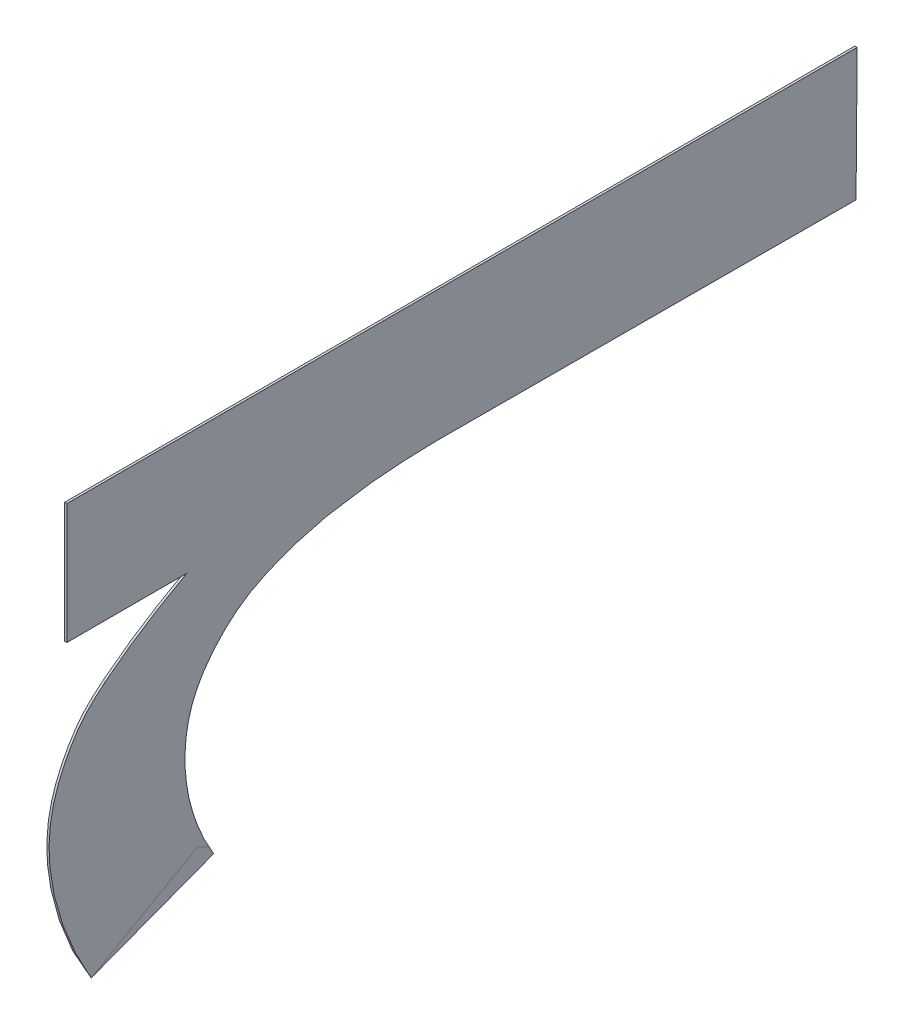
ISO-10303-21;
HEADER;
FILE_DESCRIPTION(('STEP AP214'),'2;1');
FILE_NAME('part.step','',(''),(''),'','','');
FILE_SCHEMA(('AUTOMOTIVE_DESIGN { 1 0 10303 214 1 1 1 1 }'));
ENDSEC;
DATA;
#1=APPLICATION_CONTEXT('core data for automotive mechanical design processes');
#2=APPLICATION_PROTOCOL_DEFINITION('international standard','automotive_design',2000,#1);
#3=PRODUCT_CONTEXT('',#1,'mechanical');
#4=PRODUCT('Part','Part','',(#3));
#5=PRODUCT_RELATED_PRODUCT_CATEGORY('part','',(#4));
#6=PRODUCT_DEFINITION_FORMATION('','',#4);
#7=PRODUCT_DEFINITION_CONTEXT('part definition',#1,'design');
#8=PRODUCT_DEFINITION('design','',#6,#7);
#9=PRODUCT_DEFINITION_SHAPE('','',#8);
#10=(LENGTH_UNIT() NAMED_UNIT(*) SI_UNIT(.MILLI.,.METRE.));
#11=(NAMED_UNIT(*) PLANE_ANGLE_UNIT() SI_UNIT($,.RADIAN.));
#12=(NAMED_UNIT(*) SI_UNIT($,.STERADIAN.) SOLID_ANGLE_UNIT());
#13=UNCERTAINTY_MEASURE_WITH_UNIT(LENGTH_MEASURE(1.E-05),#10,'distance_accuracy_value','');
#14=(GEOMETRIC_REPRESENTATION_CONTEXT(3) GLOBAL_UNCERTAINTY_ASSIGNED_CONTEXT((#13)) GLOBAL_UNIT_ASSIGNED_CONTEXT((#10,
#11,#12)) REPRESENTATION_CONTEXT('',''));
#15=CARTESIAN_POINT('',(0.,0.,0.));
#16=DIRECTION('',(0.,0.,1.));
#17=DIRECTION('',(1.,0.,0.));
#18=AXIS2_PLACEMENT_3D('',#15,#16,#17);
#19=CARTESIAN_POINT('',(-5.56,-5.122990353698,17.19421221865));
#20=DIRECTION('',(0.,0.,-1.));
#21=DIRECTION('',(-1.,0.,0.));
#22=AXIS2_PLACEMENT_3D('',#19,#20,#21);
#23=PLANE('',#22);
#24=DIRECTION('',(0.,-1.,0.));
#25=VECTOR('',#24,1.);
#26=CARTESIAN_POINT('',(-5.56,-5.620105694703,17.19421221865));
#27=LINE('',#26,#25);
#28=CARTESIAN_POINT('',(-5.56,-4.534565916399,17.19421221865));
#29=VERTEX_POINT('',#28);
#30=CARTESIAN_POINT('',(-5.555,-5.1229902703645,17.194212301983));
#31=VERTEX_POINT('',#30);
#32=EDGE_CURVE('E104',#29,#31,#27,.T.);
#33=ORIENTED_EDGE('',*,*,#32,.F.);
#34=DIRECTION('',(-1.,0.,0.));
#35=VECTOR('',#34,1.);
#36=CARTESIAN_POINT('',(-5.56,-4.534565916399,17.19421221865));
#37=LINE('',#36,#35);
#38=CARTESIAN_POINT('',(-5.55,-4.534565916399,17.19421221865));
#39=VERTEX_POINT('',#38);
#40=EDGE_CURVE('E140',#39,#29,#37,.T.);
#41=ORIENTED_EDGE('',*,*,#40,.F.);
#42=DIRECTION('',(0.,-1.,0.));
#43=VECTOR('',#42,1.);
#44=CARTESIAN_POINT('',(-5.55,-5.620105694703,17.19421221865));
#45=LINE('',#44,#43);
#46=EDGE_CURVE('E131',#39,#31,#45,.T.);
#47=ORIENTED_EDGE('',*,*,#46,.T.);
#48=EDGE_LOOP('',(#33,#41,#47));
#49=FACE_BOUND('',#48,.T.);
#50=ADVANCED_FACE('F17',(#49),#23,.T.);
#51=CARTESIAN_POINT('',(-5.55,-5.620105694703,20.746908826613));
#52=DIRECTION('',(-1.,0.,0.));
#53=DIRECTION('',(0.,-1.,0.));
#54=AXIS2_PLACEMENT_3D('',#51,#52,#53);
#55=PLANE('',#54);
#56=DIRECTION('',(0.,0.,1.));
#57=VECTOR('',#56,1.);
#58=CARTESIAN_POINT('',(-5.55,-4.534565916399,17.19421221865));
#59=LINE('',#58,#57);
#60=CARTESIAN_POINT('',(-5.55,-4.534565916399,20.699035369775));
#61=VERTEX_POINT('',#60);
#62=EDGE_CURVE('E143',#61,#39,#59,.F.);
#63=ORIENTED_EDGE('',*,*,#62,.F.);
#64=DIRECTION('',(0.,1.,0.));
#65=VECTOR('',#64,1.);
#66=CARTESIAN_POINT('',(-5.55,-4.534565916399,20.699035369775));
#67=LINE('',#66,#65);
#68=CARTESIAN_POINT('',(-5.55,-5.068327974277,20.699035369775));
#69=VERTEX_POINT('',#68);
#70=EDGE_CURVE('E90',#69,#61,#67,.T.);
#71=ORIENTED_EDGE('',*,*,#70,.F.);
#72=DIRECTION('',(0.,0.,1.));
#73=VECTOR('',#72,1.);
#74=CARTESIAN_POINT('',(-5.55,-5.068327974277,20.699035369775));
#75=LINE('',#74,#73);
#76=CARTESIAN_POINT('',(-5.55,-5.068327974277,20.168488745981));
#77=VERTEX_POINT('',#76);
#78=EDGE_CURVE('E91',#77,#69,#75,.T.);
#79=ORIENTED_EDGE('',*,*,#78,.F.);
#80=CARTESIAN_POINT('',(-5.55,-6.415594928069,20.586495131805));
#81=CARTESIAN_POINT('',(-5.55,-6.280176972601,20.670325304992));
#82=CARTESIAN_POINT('',(-5.55,-6.010180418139,20.780076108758));
#83=CARTESIAN_POINT('',(-5.55,-5.685238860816,20.792488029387));
#84=CARTESIAN_POINT('',(-5.55,-5.424851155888,20.658232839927));
#85=CARTESIAN_POINT('',(-5.55,-5.295983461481,20.53338967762));
#86=CARTESIAN_POINT('',(-5.55,-5.158919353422,20.33457294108));
#87=CARTESIAN_POINT('',(-5.55,-5.068327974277,20.168488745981));
#88=B_SPLINE_CURVE_WITH_KNOTS('',3,(#80,#81,#82,#83,#84,#85,#86,#87),.UNSPECIFIED.,.F.,.F.,(4,1,
1,1,1,4),(0.409840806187,0.447004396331,0.484167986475,0.502749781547,0.521331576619,
0.558495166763),.UNSPECIFIED.);
#89=CARTESIAN_POINT('',(-5.555,-6.41559487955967,20.5864951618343));
#90=VERTEX_POINT('',#89);
#91=EDGE_CURVE('E86',#90,#77,#88,.T.);
#92=ORIENTED_EDGE('',*,*,#91,.F.);
#93=CARTESIAN_POINT('',(-5.56,-6.209807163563,20.043087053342));
#94=DIRECTION('',(0.,-0.354153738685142,0.935187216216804));
#95=VECTOR('',#94,1.);
#96=LINE('',#93,#95);
#97=CARTESIAN_POINT('',(-5.555,-6.209807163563,20.043087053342));
#98=VERTEX_POINT('',#97);
#99=EDGE_CURVE('E74',#98,#90,#96,.T.);
#100=ORIENTED_EDGE('',*,*,#99,.F.);
#101=CARTESIAN_POINT('',(-5.56,-5.122990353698,17.19421221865));
#102=CARTESIAN_POINT('',(-5.56,-5.122990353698,19.0563915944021));
#103=CARTESIAN_POINT('',(-5.56,-5.12334341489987,19.0730340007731));
#104=CARTESIAN_POINT('',(-5.56,-5.13127077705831,19.446709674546));
#105=CARTESIAN_POINT('',(-5.56,-5.20528925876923,19.6753130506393));
#106=CARTESIAN_POINT('',(-5.56,-5.22766131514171,19.74440832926));
#107=CARTESIAN_POINT('',(-5.56,-5.25664159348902,19.8080417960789));
#108=CARTESIAN_POINT('',(-5.56,-5.29866135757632,19.9003067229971));
#109=CARTESIAN_POINT('',(-5.56,-5.35788951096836,19.9660303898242));
#110=CARTESIAN_POINT('',(-5.56,-5.44012689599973,20.0572866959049));
#111=CARTESIAN_POINT('',(-5.56,-5.53546514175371,20.1079869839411));
#112=CARTESIAN_POINT('',(-5.56,-5.62844010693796,20.1574304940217));
#113=CARTESIAN_POINT('',(-5.56,-5.74775554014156,20.1642888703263));
#114=CARTESIAN_POINT('',(-5.56,-5.97363928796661,20.1772729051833));
#115=CARTESIAN_POINT('',(-5.56,-6.209807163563,20.043087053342));
#116=B_SPLINE_CURVE_WITH_KNOTS('',2,(#101,#102,#103,#104,#105,#106,#107,#108,#109,#110,#111,
#112,#113,#114,#115),.UNSPECIFIED.,.F.,.F.,(3,2,2,2,2,2,2,3),(0.,0.5,0.642857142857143,
0.685714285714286,0.75,0.8125,0.875,1.),.UNSPECIFIED.);
#117=EDGE_CURVE('E103',#31,#98,#116,.T.);
#118=ORIENTED_EDGE('',*,*,#117,.F.);
#119=ORIENTED_EDGE('',*,*,#46,.F.);
#120=EDGE_LOOP('',(#63,#71,#79,#92,#100,#118,#119));
#121=FACE_BOUND('',#120,.T.);
#122=ADVANCED_FACE('F110',(#121),#55,.F.);
#123=CARTESIAN_POINT('',(-5.56,-5.068327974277,20.168488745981));
#124=CARTESIAN_POINT('',(-5.55,-5.068327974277,20.168488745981));
#125=CARTESIAN_POINT('',(-5.56,-5.158919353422,20.33457294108));
#126=CARTESIAN_POINT('',(-5.55,-5.158919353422,20.33457294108));
#127=CARTESIAN_POINT('',(-5.56,-5.295983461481,20.53338967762));
#128=CARTESIAN_POINT('',(-5.55,-5.295983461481,20.53338967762));
#129=CARTESIAN_POINT('',(-5.56,-5.424851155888,20.658232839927));
#130=CARTESIAN_POINT('',(-5.55,-5.424851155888,20.658232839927));
#131=CARTESIAN_POINT('',(-5.56,-5.685238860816,20.792488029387));
#132=CARTESIAN_POINT('',(-5.55,-5.685238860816,20.792488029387));
#133=CARTESIAN_POINT('',(-5.56,-6.010180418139,20.780076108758));
#134=CARTESIAN_POINT('',(-5.55,-6.010180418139,20.780076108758));
#135=CARTESIAN_POINT('',(-5.56,-6.280176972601,20.670325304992));
#136=CARTESIAN_POINT('',(-5.55,-6.280176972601,20.670325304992));
#137=CARTESIAN_POINT('',(-5.56,-6.415594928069,20.586495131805));
#138=CARTESIAN_POINT('',(-5.55,-6.415594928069,20.586495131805));
#139=B_SPLINE_SURFACE_WITH_KNOTS('',3,1,((#123,#124),(#125,#126),(#127,#128),(#129,#130),(#131,
#132),(#133,#134),(#135,#136),(#137,#138)),.UNSPECIFIED.,.F.,.F.,.F.,(4,1,1,1,1,4),(2,2),
(0.409840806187,0.447004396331,0.465586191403,0.484167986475,0.521331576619,0.558495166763),(0.,
1.),.UNSPECIFIED.);
#140=CARTESIAN_POINT('',(-5.56,-6.41559487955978,20.5864951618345));
#141=CARTESIAN_POINT('',(-5.56,-6.40992623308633,20.5900043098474));
#142=CARTESIAN_POINT('',(-5.56,-6.4042351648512,20.5934770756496));
#143=CARTESIAN_POINT('',(-5.56,-6.38709398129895,20.6037840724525));
#144=CARTESIAN_POINT('',(-5.56,-6.37557663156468,20.6105065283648));
#145=CARTESIAN_POINT('',(-5.56,-6.34074920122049,20.6302097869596));
#146=CARTESIAN_POINT('',(-5.56,-6.31717032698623,20.6427222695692));
#147=CARTESIAN_POINT('',(-5.56,-6.28130005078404,20.6604563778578));
#148=CARTESIAN_POINT('',(-5.56,-6.26926131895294,20.6661945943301));
#149=CARTESIAN_POINT('',(-5.56,-6.24501930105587,20.6773124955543));
#150=CARTESIAN_POINT('',(-5.56,-6.23281601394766,20.6826921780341));
#151=CARTESIAN_POINT('',(-5.56,-6.19595708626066,20.6982758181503));
#152=CARTESIAN_POINT('',(-5.56,-6.17106120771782,20.7079199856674));
#153=CARTESIAN_POINT('',(-5.56,-6.12070111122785,20.7255883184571));
#154=CARTESIAN_POINT('',(-5.56,-6.09523686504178,20.7336124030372));
#155=CARTESIAN_POINT('',(-5.56,-6.0438244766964,20.7479536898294));
#156=CARTESIAN_POINT('',(-5.56,-6.01787631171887,20.7542708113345));
#157=CARTESIAN_POINT('',(-5.56,-5.97867579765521,20.7623314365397));
#158=CARTESIAN_POINT('',(-5.56,-5.96556518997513,20.7647821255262));
#159=CARTESIAN_POINT('',(-5.56,-5.92606650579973,20.7713174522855));
#160=CARTESIAN_POINT('',(-5.56,-5.89953270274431,20.7745800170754));
#161=CARTESIAN_POINT('',(-5.56,-5.84624423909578,20.7783875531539));
#162=CARTESIAN_POINT('',(-5.56,-5.81948948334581,20.7789312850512));
#163=CARTESIAN_POINT('',(-5.56,-5.76607959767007,20.7768320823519));
#164=CARTESIAN_POINT('',(-5.56,-5.73942451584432,20.774187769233));
#165=CARTESIAN_POINT('',(-5.56,-5.68665892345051,20.7654667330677));
#166=CARTESIAN_POINT('',(-5.56,-5.66054854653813,20.7593891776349));
#167=CARTESIAN_POINT('',(-5.56,-5.62219910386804,20.7477474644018));
#168=CARTESIAN_POINT('',(-5.56,-5.60956188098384,20.7434504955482));
#169=CARTESIAN_POINT('',(-5.56,-5.58456511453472,20.7341233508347));
#170=CARTESIAN_POINT('',(-5.56,-5.57220553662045,20.7290932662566));
#171=CARTESIAN_POINT('',(-5.56,-5.53550310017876,20.7130649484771));
#172=CARTESIAN_POINT('',(-5.56,-5.51155841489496,20.701135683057));
#173=CARTESIAN_POINT('',(-5.56,-5.47663316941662,20.6815378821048));
#174=CARTESIAN_POINT('',(-5.56,-5.46516168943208,20.6747247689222));
#175=CARTESIAN_POINT('',(-5.56,-5.44258765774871,20.6604306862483));
#176=CARTESIAN_POINT('',(-5.56,-5.43148631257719,20.6529477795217));
#177=CARTESIAN_POINT('',(-5.56,-5.40988490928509,20.6371612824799));
#178=CARTESIAN_POINT('',(-5.56,-5.3993845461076,20.6288581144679));
#179=CARTESIAN_POINT('',(-5.56,-5.3791350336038,20.6113779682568));
#180=CARTESIAN_POINT('',(-5.56,-5.36938602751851,20.602200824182));
#181=CARTESIAN_POINT('',(-5.56,-5.35057573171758,20.5831608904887));
#182=CARTESIAN_POINT('',(-5.56,-5.3415151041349,20.5732974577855));
#183=CARTESIAN_POINT('',(-5.56,-5.32385208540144,20.5532290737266));
#184=CARTESIAN_POINT('',(-5.56,-5.31524836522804,20.5430252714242));
#185=CARTESIAN_POINT('',(-5.56,-5.29834139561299,20.5223784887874));
#186=CARTESIAN_POINT('',(-5.56,-5.29003804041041,20.5119355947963));
#187=CARTESIAN_POINT('',(-5.56,-5.27369905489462,20.4908501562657));
#188=CARTESIAN_POINT('',(-5.56,-5.2656633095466,20.480207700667));
#189=CARTESIAN_POINT('',(-5.56,-5.2498211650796,20.4587542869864));
#190=CARTESIAN_POINT('',(-5.56,-5.24201476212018,20.4479433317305));
#191=CARTESIAN_POINT('',(-5.56,-5.21890313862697,20.4152884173));
#192=CARTESIAN_POINT('',(-5.56,-5.20390724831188,20.3932246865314));
#193=CARTESIAN_POINT('',(-5.56,-5.1819486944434,20.3597836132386));
#194=CARTESIAN_POINT('',(-5.56,-5.17471884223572,20.3485797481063));
#195=CARTESIAN_POINT('',(-5.56,-5.16042846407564,20.3260644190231));
#196=CARTESIAN_POINT('',(-5.56,-5.15336793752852,20.3147529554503));
#197=CARTESIAN_POINT('',(-5.56,-5.13279314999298,20.2812641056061));
#198=CARTESIAN_POINT('',(-5.56,-5.11950394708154,20.2589482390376));
#199=CARTESIAN_POINT('',(-5.56,-5.09349466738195,20.213966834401));
#200=CARTESIAN_POINT('',(-5.56,-5.08077498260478,20.1913010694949));
#201=CARTESIAN_POINT('',(-5.56,-5.068327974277,20.168488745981));
#202=B_SPLINE_CURVE_WITH_KNOTS('',3,(#140,#141,#142,#143,#144,#145,#146,#147,#148,#149,#150,
#151,#152,#153,#154,#155,#156,#157,#158,#159,#160,#161,#162,#163,#164,#165,#166,#167,#168,#169,
#170,#171,#172,#173,#174,#175,#176,#177,#178,#179,#180,#181,#182,#183,#184,#185,#186,#187,#188,
#189,#190,#191,#192,#193,#194,#195,#196,#197,#198,#199,#200,#201),.UNSPECIFIED.,.F.,.F.,(4,2,2,
2,2,2,2,2,2,2,2,2,2,2,2,2,2,2,2,2,2,2,2,2,2,2,2,2,2,2,4),(0.,0.0200004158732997,
0.0600038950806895,0.140034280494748,0.180038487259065,0.220042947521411,0.300081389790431,
0.380123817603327,0.46017002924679,0.500177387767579,0.580257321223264,0.66037375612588,
0.740524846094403,0.820695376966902,0.860715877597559,0.900731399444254,0.980831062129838,
1.02084466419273,1.06097798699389,1.10109075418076,1.14121114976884,1.18136965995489,
1.22140412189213,1.26142434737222,1.30142714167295,1.34142926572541,1.42144211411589,
1.46144334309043,1.50144443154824,1.57935428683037,1.65731696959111),.UNSPECIFIED.);
#203=CARTESIAN_POINT('',(-5.56,-5.068327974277,20.168488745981));
#204=VERTEX_POINT('',#203);
#205=EDGE_CURVE('E85',#90,#204,#202,.T.);
#206=DIRECTION('',(1.,0.,0.));
#207=VECTOR('',#206,1.);
#208=CARTESIAN_POINT('',(-5.56,-5.068327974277,20.168488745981));
#209=LINE('',#208,#207);
#210=EDGE_CURVE('E82',#204,#77,#209,.T.);
#211=ORIENTED_EDGE('',*,*,#205,.F.);
#212=ORIENTED_EDGE('',*,*,#91,.T.);
#213=ORIENTED_EDGE('',*,*,#210,.F.);
#214=EDGE_LOOP('',(#211,#212,#213));
#215=FACE_BOUND('',#214,.T.);
#216=ADVANCED_FACE('F19',(#215),#139,.T.);
#217=CARTESIAN_POINT('',(-5.56,-5.068327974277,20.699035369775));
#218=DIRECTION('',(0.,-1.,0.));
#219=DIRECTION('',(1.,0.,0.));
#220=AXIS2_PLACEMENT_3D('',#217,#218,#219);
#221=PLANE('',#220);
#222=DIRECTION('',(0.,0.,1.));
#223=VECTOR('',#222,1.);
#224=CARTESIAN_POINT('',(-5.56,-5.068327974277,20.746908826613));
#225=LINE('',#224,#223);
#226=CARTESIAN_POINT('',(-5.56,-5.068327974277,20.699035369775));
#227=VERTEX_POINT('',#226);
#228=EDGE_CURVE('E94',#204,#227,#225,.T.);
#229=ORIENTED_EDGE('',*,*,#228,.F.);
#230=ORIENTED_EDGE('',*,*,#210,.T.);
#231=ORIENTED_EDGE('',*,*,#78,.T.);
#232=DIRECTION('',(1.,0.,0.));
#233=VECTOR('',#232,1.);
#234=CARTESIAN_POINT('',(-5.56,-5.068327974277,20.699035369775));
#235=LINE('',#234,#233);
#236=EDGE_CURVE('E97',#227,#69,#235,.T.);
#237=ORIENTED_EDGE('',*,*,#236,.F.);
#238=EDGE_LOOP('',(#229,#230,#231,#237));
#239=FACE_BOUND('',#238,.T.);
#240=ADVANCED_FACE('F95',(#239),#221,.T.);
#241=CARTESIAN_POINT('',(-5.56,-4.534565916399,20.699035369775));
#242=DIRECTION('',(0.,0.,1.));
#243=DIRECTION('',(1.,0.,0.));
#244=AXIS2_PLACEMENT_3D('',#241,#242,#243);
#245=PLANE('',#244);
#246=DIRECTION('',(0.,-1.,0.));
#247=VECTOR('',#246,1.);
#248=CARTESIAN_POINT('',(-5.56,-5.620105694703,20.699035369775));
#249=LINE('',#248,#247);
#250=CARTESIAN_POINT('',(-5.56,-4.534565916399,20.699035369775));
#251=VERTEX_POINT('',#250);
#252=EDGE_CURVE('E35',#227,#251,#249,.F.);
#253=ORIENTED_EDGE('',*,*,#252,.F.);
#254=ORIENTED_EDGE('',*,*,#236,.T.);
#255=ORIENTED_EDGE('',*,*,#70,.T.);
#256=DIRECTION('',(-1.,0.,0.));
#257=VECTOR('',#256,1.);
#258=CARTESIAN_POINT('',(-5.56,-4.534565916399,20.699035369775));
#259=LINE('',#258,#257);
#260=EDGE_CURVE('E44',#251,#61,#259,.F.);
#261=ORIENTED_EDGE('',*,*,#260,.F.);
#262=EDGE_LOOP('',(#253,#254,#255,#261));
#263=FACE_BOUND('',#262,.T.);
#264=ADVANCED_FACE('F207',(#263),#245,.T.);
#265=CARTESIAN_POINT('',(-5.56,-4.534565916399,17.19421221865));
#266=DIRECTION('',(0.,1.,0.));
#267=DIRECTION('',(-1.,0.,0.));
#268=AXIS2_PLACEMENT_3D('',#265,#266,#267);
#269=PLANE('',#268);
#270=DIRECTION('',(0.,0.,1.));
#271=VECTOR('',#270,1.);
#272=CARTESIAN_POINT('',(-5.56,-4.534565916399,20.746908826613));
#273=LINE('',#272,#271);
#274=EDGE_CURVE('E11',#251,#29,#273,.F.);
#275=ORIENTED_EDGE('',*,*,#274,.F.);
#276=ORIENTED_EDGE('',*,*,#260,.T.);
#277=ORIENTED_EDGE('',*,*,#62,.T.);
#278=ORIENTED_EDGE('',*,*,#40,.T.);
#279=EDGE_LOOP('',(#275,#276,#277,#278));
#280=FACE_BOUND('',#279,.T.);
#281=ADVANCED_FACE('F178',(#280),#269,.T.);
#282=CARTESIAN_POINT('',(-5.56,-5.620105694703,20.746908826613));
#283=DIRECTION('',(-1.,0.,0.));
#284=DIRECTION('',(0.,-1.,0.));
#285=AXIS2_PLACEMENT_3D('',#282,#283,#284);
#286=PLANE('',#285);
#287=ORIENTED_EDGE('',*,*,#252,.T.);
#288=ORIENTED_EDGE('',*,*,#274,.T.);
#289=ORIENTED_EDGE('',*,*,#32,.T.);
#290=ORIENTED_EDGE('',*,*,#117,.T.);
#291=ORIENTED_EDGE('',*,*,#99,.T.);
#292=ORIENTED_EDGE('',*,*,#205,.T.);
#293=ORIENTED_EDGE('',*,*,#228,.T.);
#294=EDGE_LOOP('',(#287,#288,#289,#290,#291,#292,#293));
#295=FACE_BOUND('',#294,.T.);
#296=ADVANCED_FACE('F101',(#295),#286,.T.);
#297=CLOSED_SHELL('',(#50,#122,#216,#240,#264,#281,#296));
#298=MANIFOLD_SOLID_BREP('B1',#297);
#299=ADVANCED_BREP_SHAPE_REPRESENTATION('',(#18,#298),#14);
#300=SHAPE_DEFINITION_REPRESENTATION(#9,#299);
ENDSEC;
END-ISO-10303-21;
